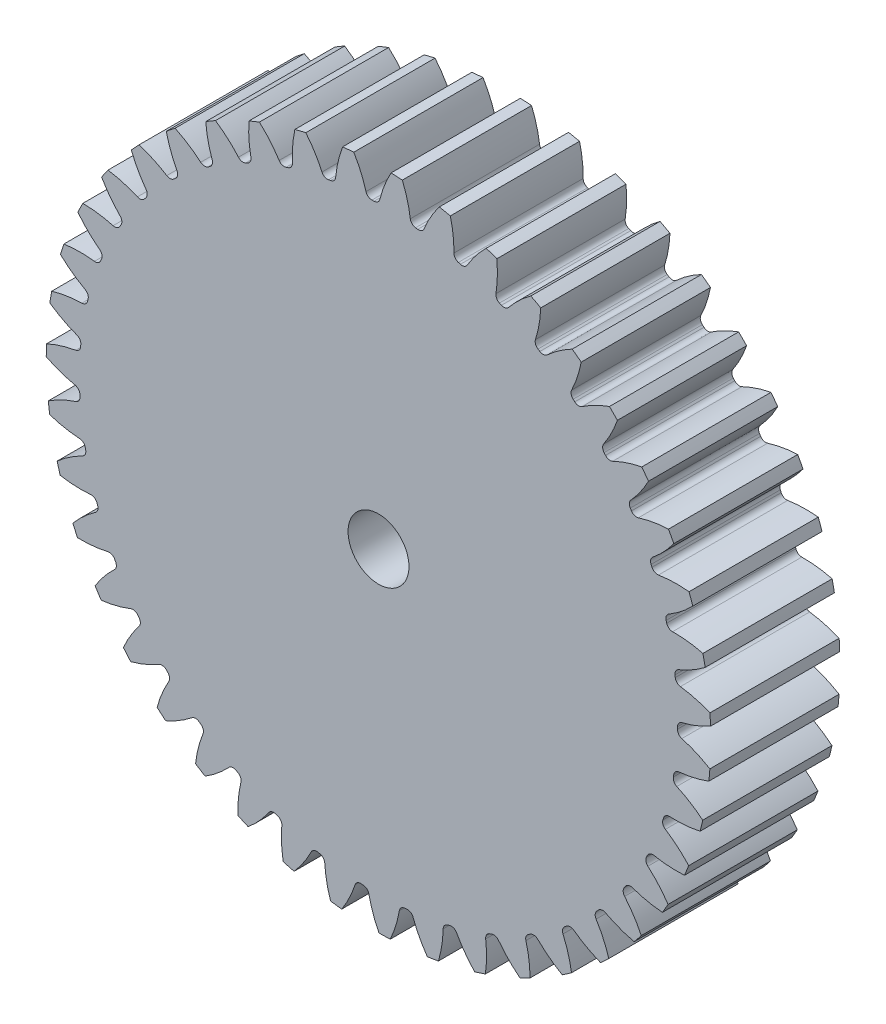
from build123d import *

# Parameters (mm, degrees)
SKETCH3_R         = 228.6
GEARBODY_DEPTH    = 88.9
TOOTHCUT_DEPTH    = 336.289621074
CIRPATTERN1_COUNT = 43
BOREDIA_R         = 20.955
BORE_DEPTH        = 12700


with BuildPart() as part:
    # Sketch3 → gearBody (new body)
    with BuildSketch(Plane.XY):
        Circle(SKETCH3_R)
    extrude(amount=GEARBODY_DEPTH)

    # Sketch2 → toothCut (cut, through all)
    with BuildSketch(Plane.XY):
        with BuildLine():
            ThreePointArc((205.69071502, -4.503038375), (205.705854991, -3.748175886), (205.718224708, -2.99326292))
            ThreePointArc((205.718224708, -2.99326292), (206.614998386, -0.481427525), (208.858788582, 0.960420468))
            ThreePointArc((208.858788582, 0.960420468), (218.989141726, 4.198295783), (228.6, 8.752337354))
            ThreePointArc((228.6, 8.752337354), (228.729520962, -4.167691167), (228.12940937, -17.07442502))
            ThreePointArc((228.12940937, -17.07442502), (218.690834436, -12.173282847), (208.685161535, -8.568508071))
            ThreePointArc((208.685161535, -8.568508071), (206.495387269, -7.045875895), (205.69071502, -4.503038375))
        make_face()
    toothcut = extrude(amount=TOOTHCUT_DEPTH, mode=Mode.SUBTRACT)

    # CirPattern1: toothCut ×43 about axis
    cirpattern1_axis = Axis((0, 0, 0), (0, 0, 1))
    for i in range(1, CIRPATTERN1_COUNT):
        add(toothcut.rotate(cirpattern1_axis, i * 360 / CIRPATTERN1_COUNT), mode=Mode.SUBTRACT)

    # boreDia → bore (cut, symmetric)
    with BuildSketch(Plane.XY):
        Circle(BOREDIA_R)
    extrude(amount=BORE_DEPTH, both=True, mode=Mode.SUBTRACT)


solid = part.part
